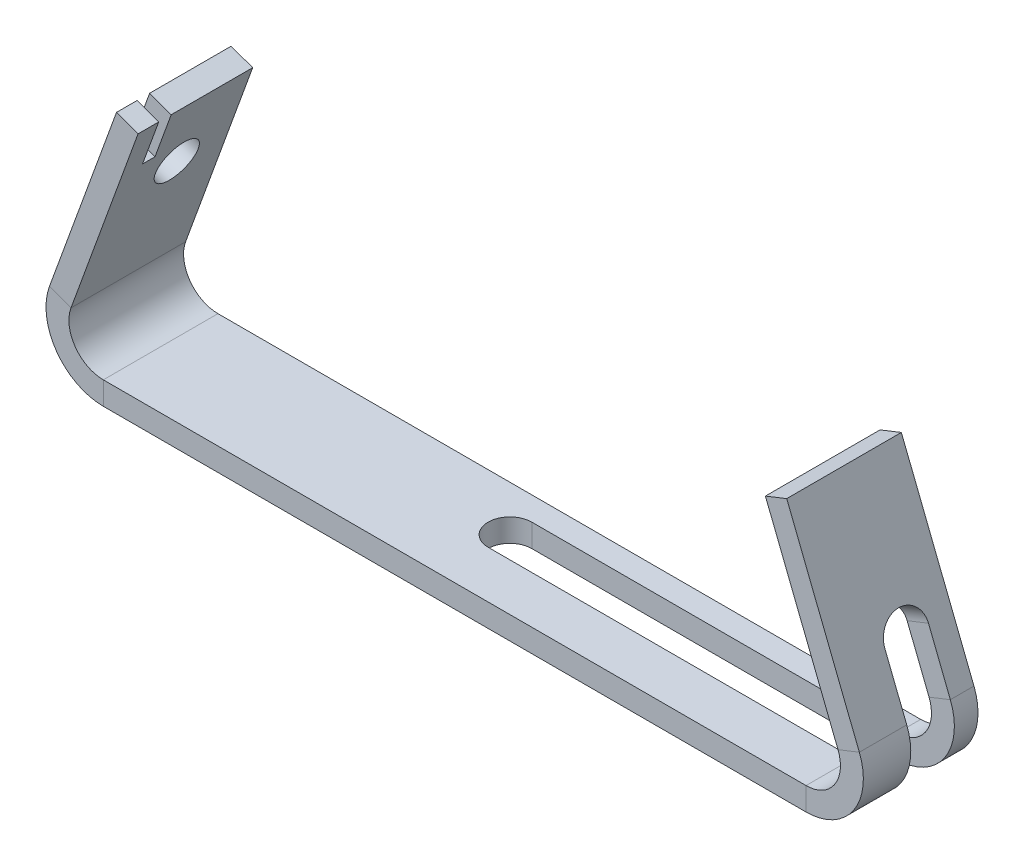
ISO-10303-21;
HEADER;
FILE_DESCRIPTION(('STEP AP214'),'2;1');
FILE_NAME('part.step','',(''),(''),'','','');
FILE_SCHEMA(('AUTOMOTIVE_DESIGN { 1 0 10303 214 1 1 1 1 }'));
ENDSEC;
DATA;
#1=APPLICATION_CONTEXT('core data for automotive mechanical design processes');
#2=APPLICATION_PROTOCOL_DEFINITION('international standard','automotive_design',2000,#1);
#3=PRODUCT_CONTEXT('',#1,'mechanical');
#4=PRODUCT('Part','Part','',(#3));
#5=PRODUCT_RELATED_PRODUCT_CATEGORY('part','',(#4));
#6=PRODUCT_DEFINITION_FORMATION('','',#4);
#7=PRODUCT_DEFINITION_CONTEXT('part definition',#1,'design');
#8=PRODUCT_DEFINITION('design','',#6,#7);
#9=PRODUCT_DEFINITION_SHAPE('','',#8);
#10=(LENGTH_UNIT() NAMED_UNIT(*) SI_UNIT(.MILLI.,.METRE.));
#11=(NAMED_UNIT(*) PLANE_ANGLE_UNIT() SI_UNIT($,.RADIAN.));
#12=(NAMED_UNIT(*) SI_UNIT($,.STERADIAN.) SOLID_ANGLE_UNIT());
#13=UNCERTAINTY_MEASURE_WITH_UNIT(LENGTH_MEASURE(1.E-05),#10,'distance_accuracy_value','');
#14=(GEOMETRIC_REPRESENTATION_CONTEXT(3) GLOBAL_UNCERTAINTY_ASSIGNED_CONTEXT((#13)) GLOBAL_UNIT_ASSIGNED_CONTEXT((#10,
#11,#12)) REPRESENTATION_CONTEXT('',''));
#15=CARTESIAN_POINT('',(0.,0.,0.));
#16=DIRECTION('',(0.,0.,1.));
#17=DIRECTION('',(1.,0.,0.));
#18=AXIS2_PLACEMENT_3D('',#15,#16,#17);
#19=CARTESIAN_POINT('',(-35.,0.,10.));
#20=DIRECTION('',(0.,1.,0.));
#21=DIRECTION('',(0.,0.,1.));
#22=AXIS2_PLACEMENT_3D('',#19,#20,#21);
#23=PLANE('',#22);
#24=CARTESIAN_POINT('',(-1.28081386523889,0.,3.96320794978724));
#25=DIRECTION('',(0.,1.,0.));
#26=DIRECTION('',(0.,0.,1.));
#27=AXIS2_PLACEMENT_3D('',#24,#25,#26);
#28=CIRCLE('',#27,1.90265373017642);
#29=CARTESIAN_POINT('',(-1.28081386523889,0.,2.06055421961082));
#30=VERTEX_POINT('',#29);
#31=CARTESIAN_POINT('',(-1.28081386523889,0.,5.86586167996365));
#32=VERTEX_POINT('',#31);
#33=EDGE_CURVE('E230',#30,#32,#28,.T.);
#34=ORIENTED_EDGE('',*,*,#33,.F.);
#35=DIRECTION('',(-1.,0.,0.));
#36=VECTOR('',#35,1.);
#37=CARTESIAN_POINT('',(-35.,0.,2.06055421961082));
#38=LINE('',#37,#36);
#39=CARTESIAN_POINT('',(30.5847915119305,0.,2.06055421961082));
#40=VERTEX_POINT('',#39);
#41=EDGE_CURVE('E214',#40,#30,#38,.T.);
#42=ORIENTED_EDGE('',*,*,#41,.F.);
#43=DIRECTION('',(0.,0.,-1.));
#44=VECTOR('',#43,1.);
#45=CARTESIAN_POINT('',(30.5847915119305,0.,10.));
#46=LINE('',#45,#44);
#47=CARTESIAN_POINT('',(30.5847915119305,0.,0.));
#48=VERTEX_POINT('',#47);
#49=EDGE_CURVE('E411',#40,#48,#46,.T.);
#50=ORIENTED_EDGE('',*,*,#49,.T.);
#51=DIRECTION('',(1.,0.,0.));
#52=VECTOR('',#51,1.);
#53=CARTESIAN_POINT('',(-35.,0.,0.));
#54=LINE('',#53,#52);
#55=CARTESIAN_POINT('',(-30.7155559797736,0.,0.));
#56=VERTEX_POINT('',#55);
#57=EDGE_CURVE('E361',#56,#48,#54,.T.);
#58=ORIENTED_EDGE('',*,*,#57,.F.);
#59=DIRECTION('',(0.,0.,-1.));
#60=VECTOR('',#59,1.);
#61=CARTESIAN_POINT('',(-30.7155559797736,0.,10.));
#62=LINE('',#61,#60);
#63=CARTESIAN_POINT('',(-30.7155559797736,0.,10.));
#64=VERTEX_POINT('',#63);
#65=EDGE_CURVE('E408',#64,#56,#62,.T.);
#66=ORIENTED_EDGE('',*,*,#65,.F.);
#67=DIRECTION('',(1.,0.,0.));
#68=VECTOR('',#67,1.);
#69=CARTESIAN_POINT('',(-35.,0.,10.));
#70=LINE('',#69,#68);
#71=CARTESIAN_POINT('',(30.5847915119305,0.,10.));
#72=VERTEX_POINT('',#71);
#73=EDGE_CURVE('E325',#64,#72,#70,.T.);
#74=ORIENTED_EDGE('',*,*,#73,.T.);
#75=CARTESIAN_POINT('',(30.5847915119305,0.,5.86586167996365));
#76=VERTEX_POINT('',#75);
#77=EDGE_CURVE('E412',#72,#76,#46,.T.);
#78=ORIENTED_EDGE('',*,*,#77,.T.);
#79=DIRECTION('',(1.,0.,0.));
#80=VECTOR('',#79,1.);
#81=CARTESIAN_POINT('',(-35.,0.,5.86586167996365));
#82=LINE('',#81,#80);
#83=EDGE_CURVE('E224',#32,#76,#82,.T.);
#84=ORIENTED_EDGE('',*,*,#83,.F.);
#85=EDGE_LOOP('',(#34,#42,#50,#58,#66,#74,#78,#84));
#86=FACE_BOUND('',#85,.T.);
#87=ADVANCED_FACE('F51',(#86),#23,.T.);
#88=CARTESIAN_POINT('',(-35.,-2.,10.));
#89=DIRECTION('',(0.,1.,0.));
#90=DIRECTION('',(0.,0.,1.));
#91=AXIS2_PLACEMENT_3D('',#88,#89,#90);
#92=PLANE('',#91);
#93=DIRECTION('',(1.,0.,0.));
#94=VECTOR('',#93,1.);
#95=CARTESIAN_POINT('',(-35.,-2.,2.06055421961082));
#96=LINE('',#95,#94);
#97=CARTESIAN_POINT('',(30.5847915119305,-2.,2.06055421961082));
#98=VERTEX_POINT('',#97);
#99=CARTESIAN_POINT('',(-1.28081386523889,-2.,2.06055421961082));
#100=VERTEX_POINT('',#99);
#101=EDGE_CURVE('E250',#98,#100,#96,.F.);
#102=ORIENTED_EDGE('',*,*,#101,.T.);
#103=CARTESIAN_POINT('',(-1.28081386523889,-2.,3.96320794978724));
#104=DIRECTION('',(0.,1.,0.));
#105=DIRECTION('',(0.,0.,1.));
#106=AXIS2_PLACEMENT_3D('',#103,#104,#105);
#107=CIRCLE('',#106,1.90265373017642);
#108=CARTESIAN_POINT('',(-1.28081386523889,-2.,5.86586167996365));
#109=VERTEX_POINT('',#108);
#110=EDGE_CURVE('E232',#100,#109,#107,.T.);
#111=ORIENTED_EDGE('',*,*,#110,.T.);
#112=DIRECTION('',(1.,0.,0.));
#113=VECTOR('',#112,1.);
#114=CARTESIAN_POINT('',(-35.,-2.,5.86586167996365));
#115=LINE('',#114,#113);
#116=CARTESIAN_POINT('',(30.5847915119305,-2.,5.86586167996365));
#117=VERTEX_POINT('',#116);
#118=EDGE_CURVE('E66',#109,#117,#115,.T.);
#119=ORIENTED_EDGE('',*,*,#118,.T.);
#120=DIRECTION('',(0.,0.,-1.));
#121=VECTOR('',#120,1.);
#122=CARTESIAN_POINT('',(30.5847915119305,-2.,10.));
#123=LINE('',#122,#121);
#124=CARTESIAN_POINT('',(30.5847915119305,-2.,10.));
#125=VERTEX_POINT('',#124);
#126=EDGE_CURVE('E388',#125,#117,#123,.T.);
#127=ORIENTED_EDGE('',*,*,#126,.F.);
#128=DIRECTION('',(1.,0.,0.));
#129=VECTOR('',#128,1.);
#130=CARTESIAN_POINT('',(-35.,-2.,10.));
#131=LINE('',#130,#129);
#132=CARTESIAN_POINT('',(-30.7155559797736,-2.,10.));
#133=VERTEX_POINT('',#132);
#134=EDGE_CURVE('E343',#133,#125,#131,.T.);
#135=ORIENTED_EDGE('',*,*,#134,.F.);
#136=DIRECTION('',(0.,0.,-1.));
#137=VECTOR('',#136,1.);
#138=CARTESIAN_POINT('',(-30.7155559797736,-2.,10.));
#139=LINE('',#138,#137);
#140=CARTESIAN_POINT('',(-30.7155559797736,-2.,0.));
#141=VERTEX_POINT('',#140);
#142=EDGE_CURVE('E391',#133,#141,#139,.T.);
#143=ORIENTED_EDGE('',*,*,#142,.T.);
#144=DIRECTION('',(1.,0.,0.));
#145=VECTOR('',#144,1.);
#146=CARTESIAN_POINT('',(-35.,-2.,0.));
#147=LINE('',#146,#145);
#148=CARTESIAN_POINT('',(30.5847915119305,-2.,0.));
#149=VERTEX_POINT('',#148);
#150=EDGE_CURVE('E379',#141,#149,#147,.T.);
#151=ORIENTED_EDGE('',*,*,#150,.T.);
#152=EDGE_CURVE('E387',#98,#149,#123,.T.);
#153=ORIENTED_EDGE('',*,*,#152,.F.);
#154=EDGE_LOOP('',(#102,#111,#119,#127,#135,#143,#151,#153));
#155=FACE_BOUND('',#154,.T.);
#156=ADVANCED_FACE('F504',(#155),#92,.F.);
#157=CARTESIAN_POINT('',(36.8594223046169,0.736579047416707,10.));
#158=DIRECTION('',(-0.929711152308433,-0.368289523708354,0.));
#159=DIRECTION('',(0.368289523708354,-0.929711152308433,0.));
#160=AXIS2_PLACEMENT_3D('',#157,#158,#159);
#161=PLANE('',#160);
#162=DIRECTION('',(0.368289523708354,-0.929711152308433,0.));
#163=VECTOR('',#162,1.);
#164=CARTESIAN_POINT('',(36.8594223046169,0.736579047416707,2.06055421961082));
#165=LINE('',#164,#163);
#166=CARTESIAN_POINT('',(33.3239284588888,9.66159006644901,2.06055421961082));
#167=VERTEX_POINT('',#166);
#168=CARTESIAN_POINT('',(35.2333472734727,4.84144761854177,2.06055421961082));
#169=VERTEX_POINT('',#168);
#170=EDGE_CURVE('E258',#167,#169,#165,.T.);
#171=ORIENTED_EDGE('',*,*,#170,.T.);
#172=DIRECTION('',(0.,0.,-1.));
#173=VECTOR('',#172,1.);
#174=CARTESIAN_POINT('',(35.2333472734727,4.84144761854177,10.));
#175=LINE('',#174,#173);
#176=CARTESIAN_POINT('',(35.2333472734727,4.84144761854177,0.));
#177=VERTEX_POINT('',#176);
#178=EDGE_CURVE('E349',#169,#177,#175,.T.);
#179=ORIENTED_EDGE('',*,*,#178,.T.);
#180=DIRECTION('',(-0.368289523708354,0.929711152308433,0.));
#181=VECTOR('',#180,1.);
#182=CARTESIAN_POINT('',(36.8594223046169,0.736579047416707,0.));
#183=LINE('',#182,#181);
#184=CARTESIAN_POINT('',(28.8983028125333,20.8336524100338,0.));
#185=VERTEX_POINT('',#184);
#186=EDGE_CURVE('E310',#177,#185,#183,.T.);
#187=ORIENTED_EDGE('',*,*,#186,.T.);
#188=DIRECTION('',(0.,0.,-1.));
#189=VECTOR('',#188,1.);
#190=CARTESIAN_POINT('',(28.8983028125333,20.8336524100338,10.));
#191=LINE('',#190,#189);
#192=CARTESIAN_POINT('',(28.8983028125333,20.8336524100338,10.));
#193=VERTEX_POINT('',#192);
#194=EDGE_CURVE('E420',#193,#185,#191,.T.);
#195=ORIENTED_EDGE('',*,*,#194,.F.);
#196=DIRECTION('',(-0.368289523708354,0.929711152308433,0.));
#197=VECTOR('',#196,1.);
#198=CARTESIAN_POINT('',(36.8594223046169,0.736579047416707,10.));
#199=LINE('',#198,#197);
#200=CARTESIAN_POINT('',(35.2333472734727,4.84144761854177,10.));
#201=VERTEX_POINT('',#200);
#202=EDGE_CURVE('E313',#201,#193,#199,.T.);
#203=ORIENTED_EDGE('',*,*,#202,.F.);
#204=CARTESIAN_POINT('',(35.2333472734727,4.84144761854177,5.86586167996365));
#205=VERTEX_POINT('',#204);
#206=EDGE_CURVE('E384',#201,#205,#175,.T.);
#207=ORIENTED_EDGE('',*,*,#206,.T.);
#208=DIRECTION('',(0.368289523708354,-0.929711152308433,0.));
#209=VECTOR('',#208,1.);
#210=CARTESIAN_POINT('',(36.8594223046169,0.736579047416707,5.86586167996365));
#211=LINE('',#210,#209);
#212=CARTESIAN_POINT('',(33.3239284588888,9.66159006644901,5.86586167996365));
#213=VERTEX_POINT('',#212);
#214=EDGE_CURVE('E264',#205,#213,#211,.F.);
#215=ORIENTED_EDGE('',*,*,#214,.T.);
#216=CARTESIAN_POINT('',(33.3239284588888,9.66159006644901,3.96320794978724));
#217=DIRECTION('',(-0.929711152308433,-0.368289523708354,0.));
#218=DIRECTION('',(0.368289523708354,-0.929711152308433,0.));
#219=AXIS2_PLACEMENT_3D('',#216,#217,#218);
#220=CIRCLE('',#219,1.90265373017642);
#221=EDGE_CURVE('E261',#213,#167,#220,.T.);
#222=ORIENTED_EDGE('',*,*,#221,.T.);
#223=EDGE_LOOP('',(#171,#179,#187,#195,#203,#207,#215,#222));
#224=FACE_BOUND('',#223,.T.);
#225=ADVANCED_FACE('F451',(#224),#161,.F.);
#226=CARTESIAN_POINT('',(35.,0.,10.));
#227=DIRECTION('',(-0.929711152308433,-0.368289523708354,0.));
#228=DIRECTION('',(0.368289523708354,-0.929711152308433,0.));
#229=AXIS2_PLACEMENT_3D('',#226,#227,#228);
#230=PLANE('',#229);
#231=DIRECTION('',(0.,0.,-1.));
#232=VECTOR('',#231,1.);
#233=CARTESIAN_POINT('',(33.3739249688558,4.10486857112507,10.));
#234=LINE('',#233,#232);
#235=CARTESIAN_POINT('',(33.3739249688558,4.10486857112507,2.06055421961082));
#236=VERTEX_POINT('',#235);
#237=CARTESIAN_POINT('',(33.3739249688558,4.10486857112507,0.));
#238=VERTEX_POINT('',#237);
#239=EDGE_CURVE('E414',#236,#238,#234,.T.);
#240=ORIENTED_EDGE('',*,*,#239,.F.);
#241=DIRECTION('',(0.368289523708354,-0.929711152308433,0.));
#242=VECTOR('',#241,1.);
#243=CARTESIAN_POINT('',(35.,0.,2.06055421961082));
#244=LINE('',#243,#242);
#245=CARTESIAN_POINT('',(31.4645061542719,8.9250110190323,2.06055421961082));
#246=VERTEX_POINT('',#245);
#247=EDGE_CURVE('E267',#246,#236,#244,.T.);
#248=ORIENTED_EDGE('',*,*,#247,.F.);
#249=CARTESIAN_POINT('',(31.4645061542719,8.9250110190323,3.96320794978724));
#250=DIRECTION('',(-0.929711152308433,-0.368289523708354,0.));
#251=DIRECTION('',(0.368289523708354,-0.929711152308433,0.));
#252=AXIS2_PLACEMENT_3D('',#249,#250,#251);
#253=CIRCLE('',#252,1.90265373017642);
#254=CARTESIAN_POINT('',(31.4645061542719,8.9250110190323,5.86586167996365));
#255=VERTEX_POINT('',#254);
#256=EDGE_CURVE('E269',#255,#246,#253,.T.);
#257=ORIENTED_EDGE('',*,*,#256,.F.);
#258=DIRECTION('',(-0.368289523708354,0.929711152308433,0.));
#259=VECTOR('',#258,1.);
#260=CARTESIAN_POINT('',(35.,0.,5.86586167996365));
#261=LINE('',#260,#259);
#262=CARTESIAN_POINT('',(33.3739249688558,4.10486857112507,5.86586167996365));
#263=VERTEX_POINT('',#262);
#264=EDGE_CURVE('E257',#263,#255,#261,.T.);
#265=ORIENTED_EDGE('',*,*,#264,.F.);
#266=CARTESIAN_POINT('',(33.3739249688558,4.10486857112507,10.));
#267=VERTEX_POINT('',#266);
#268=EDGE_CURVE('E415',#267,#263,#234,.T.);
#269=ORIENTED_EDGE('',*,*,#268,.F.);
#270=DIRECTION('',(-0.368289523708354,0.929711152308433,0.));
#271=VECTOR('',#270,1.);
#272=CARTESIAN_POINT('',(35.,0.,10.));
#273=LINE('',#272,#271);
#274=CARTESIAN_POINT('',(27.0388805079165,20.0970733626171,10.));
#275=VERTEX_POINT('',#274);
#276=EDGE_CURVE('E319',#267,#275,#273,.T.);
#277=ORIENTED_EDGE('',*,*,#276,.T.);
#278=DIRECTION('',(0.,0.,-1.));
#279=VECTOR('',#278,1.);
#280=CARTESIAN_POINT('',(27.0388805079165,20.0970733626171,10.));
#281=LINE('',#280,#279);
#282=CARTESIAN_POINT('',(27.0388805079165,20.0970733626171,0.));
#283=VERTEX_POINT('',#282);
#284=EDGE_CURVE('E418',#275,#283,#281,.T.);
#285=ORIENTED_EDGE('',*,*,#284,.T.);
#286=DIRECTION('',(-0.368289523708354,0.929711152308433,0.));
#287=VECTOR('',#286,1.);
#288=CARTESIAN_POINT('',(35.,0.,0.));
#289=LINE('',#288,#287);
#290=EDGE_CURVE('E355',#238,#283,#289,.T.);
#291=ORIENTED_EDGE('',*,*,#290,.F.);
#292=EDGE_LOOP('',(#240,#248,#257,#265,#269,#277,#285,#291));
#293=FACE_BOUND('',#292,.T.);
#294=ADVANCED_FACE('F458',(#293),#230,.T.);
#295=CARTESIAN_POINT('',(30.5847915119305,3.,10.));
#296=DIRECTION('',(0.,0.,-1.));
#297=DIRECTION('',(-1.,0.,0.));
#298=AXIS2_PLACEMENT_3D('',#295,#296,#297);
#299=CYLINDRICAL_SURFACE('',#298,3.);
#300=ORIENTED_EDGE('',*,*,#49,.F.);
#301=CARTESIAN_POINT('',(30.5847915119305,3.,2.06055421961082));
#302=DIRECTION('',(0.,0.,-1.));
#303=DIRECTION('',(-1.,0.,0.));
#304=AXIS2_PLACEMENT_3D('',#301,#302,#303);
#305=CIRCLE('',#304,3.);
#306=EDGE_CURVE('E247',#236,#40,#305,.T.);
#307=ORIENTED_EDGE('',*,*,#306,.F.);
#308=ORIENTED_EDGE('',*,*,#239,.T.);
#309=CARTESIAN_POINT('',(30.5847915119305,3.,0.));
#310=DIRECTION('',(0.,0.,1.));
#311=DIRECTION('',(1.,0.,0.));
#312=AXIS2_PLACEMENT_3D('',#309,#310,#311);
#313=CIRCLE('',#312,3.);
#314=EDGE_CURVE('E358',#48,#238,#313,.T.);
#315=ORIENTED_EDGE('',*,*,#314,.F.);
#316=EDGE_LOOP('',(#300,#307,#308,#315));
#317=FACE_BOUND('',#316,.T.);
#318=ADVANCED_FACE('F522',(#317),#299,.F.);
#319=ORIENTED_EDGE('',*,*,#268,.T.);
#320=CARTESIAN_POINT('',(30.5847915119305,3.,5.86586167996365));
#321=DIRECTION('',(0.,0.,1.));
#322=DIRECTION('',(1.,0.,0.));
#323=AXIS2_PLACEMENT_3D('',#320,#321,#322);
#324=CIRCLE('',#323,3.);
#325=EDGE_CURVE('E233',#76,#263,#324,.T.);
#326=ORIENTED_EDGE('',*,*,#325,.F.);
#327=ORIENTED_EDGE('',*,*,#77,.F.);
#328=CARTESIAN_POINT('',(30.5847915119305,3.,10.));
#329=DIRECTION('',(0.,0.,1.));
#330=DIRECTION('',(1.,0.,0.));
#331=AXIS2_PLACEMENT_3D('',#328,#329,#330);
#332=CIRCLE('',#331,3.);
#333=EDGE_CURVE('E322',#72,#267,#332,.T.);
#334=ORIENTED_EDGE('',*,*,#333,.T.);
#335=EDGE_LOOP('',(#319,#326,#327,#334));
#336=FACE_BOUND('',#335,.T.);
#337=ADVANCED_FACE('F464',(#336),#299,.F.);
#338=CARTESIAN_POINT('',(30.5847915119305,3.,10.));
#339=DIRECTION('',(0.,0.,-1.));
#340=DIRECTION('',(-1.,0.,0.));
#341=AXIS2_PLACEMENT_3D('',#338,#339,#340);
#342=CYLINDRICAL_SURFACE('',#341,5.);
#343=CARTESIAN_POINT('',(30.5847915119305,3.,2.06055421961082));
#344=DIRECTION('',(0.,0.,-1.));
#345=DIRECTION('',(-1.,0.,0.));
#346=AXIS2_PLACEMENT_3D('',#343,#344,#345);
#347=CIRCLE('',#346,5.);
#348=EDGE_CURVE('E241',#169,#98,#347,.T.);
#349=ORIENTED_EDGE('',*,*,#348,.T.);
#350=ORIENTED_EDGE('',*,*,#152,.T.);
#351=CARTESIAN_POINT('',(30.5847915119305,3.,0.));
#352=DIRECTION('',(0.,0.,1.));
#353=DIRECTION('',(1.,0.,0.));
#354=AXIS2_PLACEMENT_3D('',#351,#352,#353);
#355=CIRCLE('',#354,5.);
#356=EDGE_CURVE('E316',#149,#177,#355,.T.);
#357=ORIENTED_EDGE('',*,*,#356,.T.);
#358=ORIENTED_EDGE('',*,*,#178,.F.);
#359=EDGE_LOOP('',(#349,#350,#357,#358));
#360=FACE_BOUND('',#359,.T.);
#361=ADVANCED_FACE('F511',(#360),#342,.T.);
#362=CARTESIAN_POINT('',(30.5847915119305,3.,5.86586167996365));
#363=DIRECTION('',(0.,0.,-1.));
#364=DIRECTION('',(-1.,0.,0.));
#365=AXIS2_PLACEMENT_3D('',#362,#363,#364);
#366=CIRCLE('',#365,5.);
#367=EDGE_CURVE('E244',#117,#205,#366,.F.);
#368=ORIENTED_EDGE('',*,*,#367,.T.);
#369=ORIENTED_EDGE('',*,*,#206,.F.);
#370=CARTESIAN_POINT('',(30.5847915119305,3.,10.));
#371=DIRECTION('',(0.,0.,1.));
#372=DIRECTION('',(1.,0.,0.));
#373=AXIS2_PLACEMENT_3D('',#370,#371,#372);
#374=CIRCLE('',#373,5.);
#375=EDGE_CURVE('E346',#125,#201,#374,.T.);
#376=ORIENTED_EDGE('',*,*,#375,.F.);
#377=ORIENTED_EDGE('',*,*,#126,.T.);
#378=EDGE_LOOP('',(#368,#369,#376,#377));
#379=FACE_BOUND('',#378,.T.);
#380=ADVANCED_FACE('F449',(#379),#342,.T.);
#381=CARTESIAN_POINT('',(-29.5646487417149,20.7811136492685,10.));
#382=DIRECTION('',(0.342020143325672,0.939692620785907,0.));
#383=DIRECTION('',(-0.939692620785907,0.342020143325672,0.));
#384=AXIS2_PLACEMENT_3D('',#381,#382,#383);
#385=PLANE('',#384);
#386=DIRECTION('',(0.939692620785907,-0.342020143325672,0.));
#387=VECTOR('',#386,1.);
#388=CARTESIAN_POINT('',(-29.5646487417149,20.7811136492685,8.1954112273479));
#389=LINE('',#388,#387);
#390=CARTESIAN_POINT('',(-29.5646487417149,20.7811136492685,8.1954112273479));
#391=VERTEX_POINT('',#390);
#392=CARTESIAN_POINT('',(-27.6852635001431,20.0970733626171,8.1954112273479));
#393=VERTEX_POINT('',#392);
#394=EDGE_CURVE('E304',#391,#393,#389,.T.);
#395=ORIENTED_EDGE('',*,*,#394,.F.);
#396=DIRECTION('',(0.,0.,-1.));
#397=VECTOR('',#396,1.);
#398=CARTESIAN_POINT('',(-29.5646487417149,20.7811136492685,10.));
#399=LINE('',#398,#397);
#400=CARTESIAN_POINT('',(-29.5646487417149,20.7811136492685,10.));
#401=VERTEX_POINT('',#400);
#402=EDGE_CURVE('E398',#401,#391,#399,.T.);
#403=ORIENTED_EDGE('',*,*,#402,.F.);
#404=DIRECTION('',(0.939692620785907,-0.342020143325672,0.));
#405=VECTOR('',#404,1.);
#406=CARTESIAN_POINT('',(-29.5646487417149,20.7811136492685,10.));
#407=LINE('',#406,#405);
#408=CARTESIAN_POINT('',(-27.6852635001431,20.0970733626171,10.));
#409=VERTEX_POINT('',#408);
#410=EDGE_CURVE('E334',#401,#409,#407,.T.);
#411=ORIENTED_EDGE('',*,*,#410,.T.);
#412=DIRECTION('',(0.,0.,-1.));
#413=VECTOR('',#412,1.);
#414=CARTESIAN_POINT('',(-27.6852635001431,20.0970733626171,10.));
#415=LINE('',#414,#413);
#416=EDGE_CURVE('E402',#409,#393,#415,.T.);
#417=ORIENTED_EDGE('',*,*,#416,.T.);
#418=EDGE_LOOP('',(#395,#403,#411,#417));
#419=FACE_BOUND('',#418,.T.);
#420=ADVANCED_FACE('F488',(#419),#385,.T.);
#421=CARTESIAN_POINT('',(33.3739249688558,4.10486857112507,10.));
#422=DIRECTION('',(0.,0.,1.));
#423=DIRECTION('',(1.,0.,0.));
#424=AXIS2_PLACEMENT_3D('',#421,#422,#423);
#425=PLANE('',#424);
#426=DIRECTION('',(0.929711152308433,0.368289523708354,0.));
#427=VECTOR('',#426,1.);
#428=CARTESIAN_POINT('',(33.3739249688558,4.10486857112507,10.));
#429=LINE('',#428,#427);
#430=EDGE_CURVE('E59',#267,#201,#429,.T.);
#431=ORIENTED_EDGE('',*,*,#430,.F.);
#432=ORIENTED_EDGE('',*,*,#333,.F.);
#433=DIRECTION('',(0.,1.,0.));
#434=VECTOR('',#433,1.);
#435=CARTESIAN_POINT('',(30.5847915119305,-2.,10.));
#436=LINE('',#435,#434);
#437=EDGE_CURVE('E436',#125,#72,#436,.T.);
#438=ORIENTED_EDGE('',*,*,#437,.F.);
#439=ORIENTED_EDGE('',*,*,#375,.T.);
#440=EDGE_LOOP('',(#431,#432,#438,#439));
#441=FACE_BOUND('',#440,.T.);
#442=ADVANCED_FACE('F53',(#441),#425,.T.);
#443=CARTESIAN_POINT('',(30.5847915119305,-2.,10.));
#444=DIRECTION('',(0.,0.,1.));
#445=DIRECTION('',(1.,0.,0.));
#446=AXIS2_PLACEMENT_3D('',#443,#444,#445);
#447=PLANE('',#446);
#448=ORIENTED_EDGE('',*,*,#276,.F.);
#449=ORIENTED_EDGE('',*,*,#430,.T.);
#450=ORIENTED_EDGE('',*,*,#202,.T.);
#451=DIRECTION('',(0.929711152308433,0.368289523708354,0.));
#452=VECTOR('',#451,1.);
#453=CARTESIAN_POINT('',(27.0388805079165,20.0970733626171,10.));
#454=LINE('',#453,#452);
#455=EDGE_CURVE('E315',#275,#193,#454,.T.);
#456=ORIENTED_EDGE('',*,*,#455,.F.);
#457=EDGE_LOOP('',(#448,#449,#450,#456));
#458=FACE_BOUND('',#457,.T.);
#459=ADVANCED_FACE('F439',(#458),#447,.T.);
#460=CARTESIAN_POINT('',(30.5847915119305,0.,0.));
#461=DIRECTION('',(0.,0.,-1.));
#462=DIRECTION('',(-1.,0.,0.));
#463=AXIS2_PLACEMENT_3D('',#460,#461,#462);
#464=PLANE('',#463);
#465=DIRECTION('',(0.,-1.,0.));
#466=VECTOR('',#465,1.);
#467=CARTESIAN_POINT('',(30.5847915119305,0.,0.));
#468=LINE('',#467,#466);
#469=EDGE_CURVE('E433',#48,#149,#468,.T.);
#470=ORIENTED_EDGE('',*,*,#469,.F.);
#471=ORIENTED_EDGE('',*,*,#314,.T.);
#472=DIRECTION('',(-0.929711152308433,-0.368289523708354,0.));
#473=VECTOR('',#472,1.);
#474=CARTESIAN_POINT('',(35.2333472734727,4.84144761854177,0.));
#475=LINE('',#474,#473);
#476=EDGE_CURVE('E430',#177,#238,#475,.T.);
#477=ORIENTED_EDGE('',*,*,#476,.F.);
#478=ORIENTED_EDGE('',*,*,#356,.F.);
#479=EDGE_LOOP('',(#470,#471,#477,#478));
#480=FACE_BOUND('',#479,.T.);
#481=ADVANCED_FACE('F516',(#480),#464,.T.);
#482=CARTESIAN_POINT('',(35.2333472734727,4.84144761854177,0.));
#483=DIRECTION('',(0.,0.,-1.));
#484=DIRECTION('',(-1.,0.,0.));
#485=AXIS2_PLACEMENT_3D('',#482,#483,#484);
#486=PLANE('',#485);
#487=ORIENTED_EDGE('',*,*,#57,.T.);
#488=ORIENTED_EDGE('',*,*,#469,.T.);
#489=ORIENTED_EDGE('',*,*,#150,.F.);
#490=DIRECTION('',(0.,1.,0.));
#491=VECTOR('',#490,1.);
#492=CARTESIAN_POINT('',(-30.7155559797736,-2.,0.));
#493=LINE('',#492,#491);
#494=EDGE_CURVE('E422',#141,#56,#493,.T.);
#495=ORIENTED_EDGE('',*,*,#494,.T.);
#496=EDGE_LOOP('',(#487,#488,#489,#495));
#497=FACE_BOUND('',#496,.T.);
#498=ADVANCED_FACE('F524',(#497),#486,.T.);
#499=CARTESIAN_POINT('',(-30.7155559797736,0.,10.));
#500=DIRECTION('',(0.,0.,1.));
#501=DIRECTION('',(1.,0.,0.));
#502=AXIS2_PLACEMENT_3D('',#499,#500,#501);
#503=PLANE('',#502);
#504=DIRECTION('',(0.,-1.,0.));
#505=VECTOR('',#504,1.);
#506=CARTESIAN_POINT('',(-30.7155559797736,0.,10.));
#507=LINE('',#506,#505);
#508=EDGE_CURVE('E428',#64,#133,#507,.T.);
#509=ORIENTED_EDGE('',*,*,#508,.F.);
#510=CARTESIAN_POINT('',(-30.7155559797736,3.,10.));
#511=DIRECTION('',(0.,0.,1.));
#512=DIRECTION('',(1.,0.,0.));
#513=AXIS2_PLACEMENT_3D('',#510,#511,#512);
#514=CIRCLE('',#513,3.);
#515=CARTESIAN_POINT('',(-33.5346338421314,4.02606042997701,10.));
#516=VERTEX_POINT('',#515);
#517=EDGE_CURVE('E328',#516,#64,#514,.T.);
#518=ORIENTED_EDGE('',*,*,#517,.F.);
#519=DIRECTION('',(0.939692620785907,-0.342020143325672,0.));
#520=VECTOR('',#519,1.);
#521=CARTESIAN_POINT('',(-35.4140190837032,4.71010071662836,10.));
#522=LINE('',#521,#520);
#523=CARTESIAN_POINT('',(-35.4140190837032,4.71010071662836,10.));
#524=VERTEX_POINT('',#523);
#525=EDGE_CURVE('E426',#524,#516,#522,.T.);
#526=ORIENTED_EDGE('',*,*,#525,.F.);
#527=CARTESIAN_POINT('',(-30.7155559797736,3.,10.));
#528=DIRECTION('',(0.,0.,1.));
#529=DIRECTION('',(1.,0.,0.));
#530=AXIS2_PLACEMENT_3D('',#527,#528,#529);
#531=CIRCLE('',#530,5.);
#532=EDGE_CURVE('E340',#524,#133,#531,.T.);
#533=ORIENTED_EDGE('',*,*,#532,.T.);
#534=EDGE_LOOP('',(#509,#518,#526,#533));
#535=FACE_BOUND('',#534,.T.);
#536=ADVANCED_FACE('F477',(#535),#503,.T.);
#537=CARTESIAN_POINT('',(-35.4140190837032,4.71010071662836,10.));
#538=DIRECTION('',(0.,0.,1.));
#539=DIRECTION('',(1.,0.,0.));
#540=AXIS2_PLACEMENT_3D('',#537,#538,#539);
#541=PLANE('',#540);
#542=ORIENTED_EDGE('',*,*,#73,.F.);
#543=ORIENTED_EDGE('',*,*,#508,.T.);
#544=ORIENTED_EDGE('',*,*,#134,.T.);
#545=ORIENTED_EDGE('',*,*,#437,.T.);
#546=EDGE_LOOP('',(#542,#543,#544,#545));
#547=FACE_BOUND('',#546,.T.);
#548=ADVANCED_FACE('F470',(#547),#541,.T.);
#549=CARTESIAN_POINT('',(-33.5346338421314,4.02606042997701,0.));
#550=DIRECTION('',(0.,0.,-1.));
#551=DIRECTION('',(-1.,0.,0.));
#552=AXIS2_PLACEMENT_3D('',#549,#550,#551);
#553=PLANE('',#552);
#554=DIRECTION('',(-0.939692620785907,0.342020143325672,0.));
#555=VECTOR('',#554,1.);
#556=CARTESIAN_POINT('',(-33.5346338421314,4.02606042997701,0.));
#557=LINE('',#556,#555);
#558=CARTESIAN_POINT('',(-33.5346338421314,4.02606042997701,0.));
#559=VERTEX_POINT('',#558);
#560=CARTESIAN_POINT('',(-35.4140190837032,4.71010071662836,0.));
#561=VERTEX_POINT('',#560);
#562=EDGE_CURVE('E424',#559,#561,#557,.T.);
#563=ORIENTED_EDGE('',*,*,#562,.F.);
#564=CARTESIAN_POINT('',(-30.7155559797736,3.,0.));
#565=DIRECTION('',(0.,0.,1.));
#566=DIRECTION('',(1.,0.,0.));
#567=AXIS2_PLACEMENT_3D('',#564,#565,#566);
#568=CIRCLE('',#567,3.);
#569=EDGE_CURVE('E364',#559,#56,#568,.T.);
#570=ORIENTED_EDGE('',*,*,#569,.T.);
#571=ORIENTED_EDGE('',*,*,#494,.F.);
#572=CARTESIAN_POINT('',(-30.7155559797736,3.,0.));
#573=DIRECTION('',(0.,0.,1.));
#574=DIRECTION('',(1.,0.,0.));
#575=AXIS2_PLACEMENT_3D('',#572,#573,#574);
#576=CIRCLE('',#575,5.);
#577=EDGE_CURVE('E376',#561,#141,#576,.T.);
#578=ORIENTED_EDGE('',*,*,#577,.F.);
#579=EDGE_LOOP('',(#563,#570,#571,#578));
#580=FACE_BOUND('',#579,.T.);
#581=ADVANCED_FACE('F526',(#580),#553,.T.);
#582=CARTESIAN_POINT('',(-30.7155559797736,-2.,0.));
#583=DIRECTION('',(0.,0.,-1.));
#584=DIRECTION('',(-1.,0.,0.));
#585=AXIS2_PLACEMENT_3D('',#582,#583,#584);
#586=PLANE('',#585);
#587=DIRECTION('',(-0.342020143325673,-0.939692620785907,0.));
#588=VECTOR('',#587,1.);
#589=CARTESIAN_POINT('',(-27.6852635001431,20.0970733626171,0.));
#590=LINE('',#589,#588);
#591=CARTESIAN_POINT('',(-27.6852635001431,20.0970733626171,0.));
#592=VERTEX_POINT('',#591);
#593=EDGE_CURVE('E367',#592,#559,#590,.T.);
#594=ORIENTED_EDGE('',*,*,#593,.T.);
#595=ORIENTED_EDGE('',*,*,#562,.T.);
#596=DIRECTION('',(-0.342020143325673,-0.939692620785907,0.));
#597=VECTOR('',#596,1.);
#598=CARTESIAN_POINT('',(-29.5646487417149,20.7811136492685,0.));
#599=LINE('',#598,#597);
#600=CARTESIAN_POINT('',(-29.5646487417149,20.7811136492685,0.));
#601=VERTEX_POINT('',#600);
#602=EDGE_CURVE('E373',#601,#561,#599,.T.);
#603=ORIENTED_EDGE('',*,*,#602,.F.);
#604=DIRECTION('',(0.939692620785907,-0.342020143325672,0.));
#605=VECTOR('',#604,1.);
#606=CARTESIAN_POINT('',(-29.5646487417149,20.7811136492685,0.));
#607=LINE('',#606,#605);
#608=EDGE_CURVE('E370',#601,#592,#607,.T.);
#609=ORIENTED_EDGE('',*,*,#608,.T.);
#610=EDGE_LOOP('',(#594,#595,#603,#609));
#611=FACE_BOUND('',#610,.T.);
#612=ADVANCED_FACE('F528',(#611),#586,.T.);
#613=CARTESIAN_POINT('',(27.0388805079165,20.0970733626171,10.));
#614=DIRECTION('',(-0.368289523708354,0.929711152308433,0.));
#615=DIRECTION('',(-0.929711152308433,-0.368289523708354,0.));
#616=AXIS2_PLACEMENT_3D('',#613,#614,#615);
#617=PLANE('',#616);
#618=DIRECTION('',(0.929711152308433,0.368289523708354,0.));
#619=VECTOR('',#618,1.);
#620=CARTESIAN_POINT('',(27.0388805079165,20.0970733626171,0.));
#621=LINE('',#620,#619);
#622=EDGE_CURVE('E352',#283,#185,#621,.T.);
#623=ORIENTED_EDGE('',*,*,#622,.F.);
#624=ORIENTED_EDGE('',*,*,#284,.F.);
#625=ORIENTED_EDGE('',*,*,#455,.T.);
#626=ORIENTED_EDGE('',*,*,#194,.T.);
#627=EDGE_LOOP('',(#623,#624,#625,#626));
#628=FACE_BOUND('',#627,.T.);
#629=ADVANCED_FACE('F455',(#628),#617,.T.);
#630=CARTESIAN_POINT('',(-30.7155559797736,3.,10.));
#631=DIRECTION('',(0.,0.,-1.));
#632=DIRECTION('',(-1.,0.,0.));
#633=AXIS2_PLACEMENT_3D('',#630,#631,#632);
#634=CYLINDRICAL_SURFACE('',#633,3.);
#635=ORIENTED_EDGE('',*,*,#569,.F.);
#636=DIRECTION('',(0.,0.,-1.));
#637=VECTOR('',#636,1.);
#638=CARTESIAN_POINT('',(-33.5346338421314,4.02606042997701,10.));
#639=LINE('',#638,#637);
#640=EDGE_CURVE('E405',#516,#559,#639,.T.);
#641=ORIENTED_EDGE('',*,*,#640,.F.);
#642=ORIENTED_EDGE('',*,*,#517,.T.);
#643=ORIENTED_EDGE('',*,*,#65,.T.);
#644=EDGE_LOOP('',(#635,#641,#642,#643));
#645=FACE_BOUND('',#644,.T.);
#646=ADVANCED_FACE('F475',(#645),#634,.F.);
#647=CARTESIAN_POINT('',(-27.6852635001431,20.0970733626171,10.));
#648=DIRECTION('',(0.939692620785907,-0.342020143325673,0.));
#649=DIRECTION('',(0.342020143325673,0.939692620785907,0.));
#650=AXIS2_PLACEMENT_3D('',#647,#648,#649);
#651=PLANE('',#650);
#652=DIRECTION('',(0.342020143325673,0.939692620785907,0.));
#653=VECTOR('',#652,1.);
#654=CARTESIAN_POINT('',(-26.9243194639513,22.1877499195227,8.1954112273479));
#655=LINE('',#654,#653);
#656=CARTESIAN_POINT('',(-29.0985647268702,16.2140601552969,8.1954112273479));
#657=VERTEX_POINT('',#656);
#658=EDGE_CURVE('E284',#657,#393,#655,.T.);
#659=ORIENTED_EDGE('',*,*,#658,.T.);
#660=ORIENTED_EDGE('',*,*,#416,.F.);
#661=DIRECTION('',(-0.342020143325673,-0.939692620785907,0.));
#662=VECTOR('',#661,1.);
#663=CARTESIAN_POINT('',(-27.6852635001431,20.0970733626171,10.));
#664=LINE('',#663,#662);
#665=EDGE_CURVE('E331',#409,#516,#664,.T.);
#666=ORIENTED_EDGE('',*,*,#665,.T.);
#667=ORIENTED_EDGE('',*,*,#640,.T.);
#668=ORIENTED_EDGE('',*,*,#593,.F.);
#669=CARTESIAN_POINT('',(-27.6852635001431,20.0970733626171,7.10940603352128));
#670=VERTEX_POINT('',#669);
#671=EDGE_CURVE('E401',#670,#592,#415,.T.);
#672=ORIENTED_EDGE('',*,*,#671,.F.);
#673=DIRECTION('',(-0.342020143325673,-0.939692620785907,0.));
#674=VECTOR('',#673,1.);
#675=CARTESIAN_POINT('',(-26.9243194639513,22.1877499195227,7.10940603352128));
#676=LINE('',#675,#674);
#677=CARTESIAN_POINT('',(-29.0985647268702,16.2140601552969,7.10940603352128));
#678=VERTEX_POINT('',#677);
#679=EDGE_CURVE('E287',#670,#678,#676,.T.);
#680=ORIENTED_EDGE('',*,*,#679,.T.);
#681=DIRECTION('',(0.,0.,1.));
#682=VECTOR('',#681,1.);
#683=CARTESIAN_POINT('',(-29.0985647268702,16.2140601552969,7.10940603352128));
#684=LINE('',#683,#682);
#685=EDGE_CURVE('E291',#678,#657,#684,.T.);
#686=ORIENTED_EDGE('',*,*,#685,.T.);
#687=EDGE_LOOP('',(#659,#660,#666,#667,#668,#672,#680,#686));
#688=FACE_BOUND('',#687,.T.);
#689=CARTESIAN_POINT('',(-29.8286830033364,14.2080766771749,4.47767415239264));
#690=DIRECTION('',(-0.939692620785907,0.342020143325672,0.));
#691=DIRECTION('',(-0.342020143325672,-0.939692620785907,0.));
#692=AXIS2_PLACEMENT_3D('',#689,#690,#691);
#693=CIRCLE('',#692,1.87049521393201);
#694=CARTESIAN_POINT('',(-30.4684300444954,12.4503861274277,4.47767415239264));
#695=VERTEX_POINT('',#694);
#696=EDGE_CURVE('E307',#695,#695,#693,.T.);
#697=ORIENTED_EDGE('',*,*,#696,.T.);
#698=EDGE_LOOP('',(#697));
#699=FACE_BOUND('',#698,.T.);
#700=ADVANCED_FACE('F480',(#688,#699),#651,.T.);
#701=DIRECTION('',(-0.939692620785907,0.342020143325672,0.));
#702=VECTOR('',#701,1.);
#703=CARTESIAN_POINT('',(-29.5646487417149,20.7811136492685,7.10940603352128));
#704=LINE('',#703,#702);
#705=CARTESIAN_POINT('',(-29.5646487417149,20.7811136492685,7.10940603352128));
#706=VERTEX_POINT('',#705);
#707=EDGE_CURVE('E300',#670,#706,#704,.T.);
#708=ORIENTED_EDGE('',*,*,#707,.F.);
#709=ORIENTED_EDGE('',*,*,#671,.T.);
#710=ORIENTED_EDGE('',*,*,#608,.F.);
#711=EDGE_CURVE('E397',#706,#601,#399,.T.);
#712=ORIENTED_EDGE('',*,*,#711,.F.);
#713=EDGE_LOOP('',(#708,#709,#710,#712));
#714=FACE_BOUND('',#713,.T.);
#715=ADVANCED_FACE('F533',(#714),#385,.T.);
#716=CARTESIAN_POINT('',(-29.5646487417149,20.7811136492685,10.));
#717=DIRECTION('',(0.939692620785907,-0.342020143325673,0.));
#718=DIRECTION('',(0.342020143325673,0.939692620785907,0.));
#719=AXIS2_PLACEMENT_3D('',#716,#717,#718);
#720=PLANE('',#719);
#721=CARTESIAN_POINT('',(-31.7080682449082,14.8921169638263,4.47767415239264));
#722=DIRECTION('',(-0.939692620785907,0.342020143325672,0.));
#723=DIRECTION('',(-0.342020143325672,-0.939692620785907,0.));
#724=AXIS2_PLACEMENT_3D('',#721,#722,#723);
#725=CIRCLE('',#724,1.87049521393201);
#726=CARTESIAN_POINT('',(-32.3478152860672,13.134426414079,4.47767415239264));
#727=VERTEX_POINT('',#726);
#728=EDGE_CURVE('E306',#727,#727,#725,.T.);
#729=ORIENTED_EDGE('',*,*,#728,.F.);
#730=EDGE_LOOP('',(#729));
#731=FACE_BOUND('',#730,.T.);
#732=ORIENTED_EDGE('',*,*,#402,.T.);
#733=DIRECTION('',(0.342020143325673,0.939692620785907,0.));
#734=VECTOR('',#733,1.);
#735=CARTESIAN_POINT('',(-28.8037047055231,22.871790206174,8.1954112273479));
#736=LINE('',#735,#734);
#737=CARTESIAN_POINT('',(-30.977949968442,16.8981004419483,8.1954112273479));
#738=VERTEX_POINT('',#737);
#739=EDGE_CURVE('E282',#738,#391,#736,.T.);
#740=ORIENTED_EDGE('',*,*,#739,.F.);
#741=DIRECTION('',(0.,0.,1.));
#742=VECTOR('',#741,1.);
#743=CARTESIAN_POINT('',(-30.977949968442,16.8981004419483,7.10940603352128));
#744=LINE('',#743,#742);
#745=CARTESIAN_POINT('',(-30.977949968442,16.8981004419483,7.10940603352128));
#746=VERTEX_POINT('',#745);
#747=EDGE_CURVE('E288',#746,#738,#744,.T.);
#748=ORIENTED_EDGE('',*,*,#747,.F.);
#749=DIRECTION('',(0.342020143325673,0.939692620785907,0.));
#750=VECTOR('',#749,1.);
#751=CARTESIAN_POINT('',(-29.5646487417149,20.7811136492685,7.10940603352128));
#752=LINE('',#751,#750);
#753=EDGE_CURVE('E13',#746,#706,#752,.T.);
#754=ORIENTED_EDGE('',*,*,#753,.T.);
#755=ORIENTED_EDGE('',*,*,#711,.T.);
#756=ORIENTED_EDGE('',*,*,#602,.T.);
#757=DIRECTION('',(0.,0.,-1.));
#758=VECTOR('',#757,1.);
#759=CARTESIAN_POINT('',(-35.4140190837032,4.71010071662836,10.));
#760=LINE('',#759,#758);
#761=EDGE_CURVE('E394',#524,#561,#760,.T.);
#762=ORIENTED_EDGE('',*,*,#761,.F.);
#763=DIRECTION('',(-0.342020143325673,-0.939692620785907,0.));
#764=VECTOR('',#763,1.);
#765=CARTESIAN_POINT('',(-29.5646487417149,20.7811136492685,10.));
#766=LINE('',#765,#764);
#767=EDGE_CURVE('E337',#401,#524,#766,.T.);
#768=ORIENTED_EDGE('',*,*,#767,.F.);
#769=EDGE_LOOP('',(#732,#740,#748,#754,#755,#756,#762,#768));
#770=FACE_BOUND('',#769,.T.);
#771=ADVANCED_FACE('F493',(#731,#770),#720,.F.);
#772=CARTESIAN_POINT('',(-30.7155559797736,3.,10.));
#773=DIRECTION('',(0.,0.,-1.));
#774=DIRECTION('',(-1.,0.,0.));
#775=AXIS2_PLACEMENT_3D('',#772,#773,#774);
#776=CYLINDRICAL_SURFACE('',#775,5.);
#777=ORIENTED_EDGE('',*,*,#577,.T.);
#778=ORIENTED_EDGE('',*,*,#142,.F.);
#779=ORIENTED_EDGE('',*,*,#532,.F.);
#780=ORIENTED_EDGE('',*,*,#761,.T.);
#781=EDGE_LOOP('',(#777,#778,#779,#780));
#782=FACE_BOUND('',#781,.T.);
#783=ADVANCED_FACE('F499',(#782),#776,.T.);
#784=CARTESIAN_POINT('',(30.5847915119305,3.,10.));
#785=DIRECTION('',(0.,0.,1.));
#786=DIRECTION('',(1.,0.,0.));
#787=AXIS2_PLACEMENT_3D('',#784,#785,#786);
#788=PLANE('',#787);
#789=ORIENTED_EDGE('',*,*,#767,.T.);
#790=ORIENTED_EDGE('',*,*,#525,.T.);
#791=ORIENTED_EDGE('',*,*,#665,.F.);
#792=ORIENTED_EDGE('',*,*,#410,.F.);
#793=EDGE_LOOP('',(#789,#790,#791,#792));
#794=FACE_BOUND('',#793,.T.);
#795=ADVANCED_FACE('F485',(#794),#788,.T.);
#796=CARTESIAN_POINT('',(30.5847915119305,3.,0.));
#797=DIRECTION('',(0.,0.,1.));
#798=DIRECTION('',(1.,0.,0.));
#799=AXIS2_PLACEMENT_3D('',#796,#797,#798);
#800=PLANE('',#799);
#801=ORIENTED_EDGE('',*,*,#186,.F.);
#802=ORIENTED_EDGE('',*,*,#476,.T.);
#803=ORIENTED_EDGE('',*,*,#290,.T.);
#804=ORIENTED_EDGE('',*,*,#622,.T.);
#805=EDGE_LOOP('',(#801,#802,#803,#804));
#806=FACE_BOUND('',#805,.T.);
#807=ADVANCED_FACE('F519',(#806),#800,.F.);
#808=CARTESIAN_POINT('',(-29.8286830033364,14.2080766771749,4.47767415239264));
#809=DIRECTION('',(-0.939692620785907,0.342020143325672,0.));
#810=DIRECTION('',(-0.342020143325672,-0.939692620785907,0.));
#811=AXIS2_PLACEMENT_3D('',#808,#809,#810);
#812=CYLINDRICAL_SURFACE('',#811,1.87049521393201);
#813=ORIENTED_EDGE('',*,*,#696,.F.);
#814=EDGE_LOOP('',(#813));
#815=FACE_BOUND('',#814,.T.);
#816=ORIENTED_EDGE('',*,*,#728,.T.);
#817=EDGE_LOOP('',(#816));
#818=FACE_BOUND('',#817,.T.);
#819=ADVANCED_FACE('F545',(#815,#818),#812,.F.);
#820=CARTESIAN_POINT('',(-26.9243194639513,22.1877499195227,8.1954112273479));
#821=DIRECTION('',(0.,0.,1.));
#822=DIRECTION('',(1.,0.,0.));
#823=AXIS2_PLACEMENT_3D('',#820,#821,#822);
#824=PLANE('',#823);
#825=ORIENTED_EDGE('',*,*,#394,.T.);
#826=ORIENTED_EDGE('',*,*,#658,.F.);
#827=DIRECTION('',(-0.939692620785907,0.342020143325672,0.));
#828=VECTOR('',#827,1.);
#829=CARTESIAN_POINT('',(-29.0985647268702,16.2140601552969,8.1954112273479));
#830=LINE('',#829,#828);
#831=EDGE_CURVE('E298',#657,#738,#830,.T.);
#832=ORIENTED_EDGE('',*,*,#831,.T.);
#833=ORIENTED_EDGE('',*,*,#739,.T.);
#834=EDGE_LOOP('',(#825,#826,#832,#833));
#835=FACE_BOUND('',#834,.T.);
#836=ADVANCED_FACE('F543',(#835),#824,.F.);
#837=CARTESIAN_POINT('',(-29.0985647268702,16.2140601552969,7.10940603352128));
#838=DIRECTION('',(-0.342020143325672,-0.939692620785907,0.));
#839=DIRECTION('',(0.939692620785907,-0.342020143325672,0.));
#840=AXIS2_PLACEMENT_3D('',#837,#838,#839);
#841=PLANE('',#840);
#842=ORIENTED_EDGE('',*,*,#747,.T.);
#843=ORIENTED_EDGE('',*,*,#831,.F.);
#844=ORIENTED_EDGE('',*,*,#685,.F.);
#845=DIRECTION('',(-0.939692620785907,0.342020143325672,0.));
#846=VECTOR('',#845,1.);
#847=CARTESIAN_POINT('',(-29.0985647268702,16.2140601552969,7.10940603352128));
#848=LINE('',#847,#846);
#849=EDGE_CURVE('E294',#678,#746,#848,.T.);
#850=ORIENTED_EDGE('',*,*,#849,.T.);
#851=EDGE_LOOP('',(#842,#843,#844,#850));
#852=FACE_BOUND('',#851,.T.);
#853=ADVANCED_FACE('F539',(#852),#841,.F.);
#854=CARTESIAN_POINT('',(-26.9243194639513,22.1877499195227,7.10940603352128));
#855=DIRECTION('',(0.,0.,-1.));
#856=DIRECTION('',(0.,1.,0.));
#857=AXIS2_PLACEMENT_3D('',#854,#855,#856);
#858=PLANE('',#857);
#859=ORIENTED_EDGE('',*,*,#707,.T.);
#860=ORIENTED_EDGE('',*,*,#753,.F.);
#861=ORIENTED_EDGE('',*,*,#849,.F.);
#862=ORIENTED_EDGE('',*,*,#679,.F.);
#863=EDGE_LOOP('',(#859,#860,#861,#862));
#864=FACE_BOUND('',#863,.T.);
#865=ADVANCED_FACE('F536',(#864),#858,.F.);
#866=CARTESIAN_POINT('',(31.4645061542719,8.9250110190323,3.96320794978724));
#867=DIRECTION('',(-0.929711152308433,-0.368289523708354,0.));
#868=DIRECTION('',(0.368289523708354,-0.929711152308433,0.));
#869=AXIS2_PLACEMENT_3D('',#866,#867,#868);
#870=CYLINDRICAL_SURFACE('',#869,1.90265373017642);
#871=DIRECTION('',(-0.929711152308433,-0.368289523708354,0.));
#872=VECTOR('',#871,1.);
#873=CARTESIAN_POINT('',(31.4645061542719,8.9250110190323,5.86586167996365));
#874=LINE('',#873,#872);
#875=EDGE_CURVE('E279',#255,#213,#874,.F.);
#876=ORIENTED_EDGE('',*,*,#875,.F.);
#877=ORIENTED_EDGE('',*,*,#256,.T.);
#878=DIRECTION('',(-0.929711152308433,-0.368289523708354,0.));
#879=VECTOR('',#878,1.);
#880=CARTESIAN_POINT('',(31.4645061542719,8.9250110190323,2.06055421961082));
#881=LINE('',#880,#879);
#882=EDGE_CURVE('E276',#246,#167,#881,.F.);
#883=ORIENTED_EDGE('',*,*,#882,.T.);
#884=ORIENTED_EDGE('',*,*,#221,.F.);
#885=EDGE_LOOP('',(#876,#877,#883,#884));
#886=FACE_BOUND('',#885,.T.);
#887=ADVANCED_FACE('F678',(#886),#870,.F.);
#888=CARTESIAN_POINT('',(35.,0.,2.06055421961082));
#889=DIRECTION('',(0.,0.,-1.));
#890=DIRECTION('',(0.368289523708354,-0.929711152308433,0.));
#891=AXIS2_PLACEMENT_3D('',#888,#889,#890);
#892=PLANE('',#891);
#893=ORIENTED_EDGE('',*,*,#882,.F.);
#894=ORIENTED_EDGE('',*,*,#247,.T.);
#895=DIRECTION('',(-0.929711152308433,-0.368289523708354,0.));
#896=VECTOR('',#895,1.);
#897=CARTESIAN_POINT('',(33.3739249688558,4.10486857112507,2.06055421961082));
#898=LINE('',#897,#896);
#899=EDGE_CURVE('E273',#236,#169,#898,.F.);
#900=ORIENTED_EDGE('',*,*,#899,.T.);
#901=ORIENTED_EDGE('',*,*,#170,.F.);
#902=EDGE_LOOP('',(#893,#894,#900,#901));
#903=FACE_BOUND('',#902,.T.);
#904=ADVANCED_FACE('F723',(#903),#892,.F.);
#905=CARTESIAN_POINT('',(35.,0.,5.86586167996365));
#906=DIRECTION('',(0.,0.,1.));
#907=DIRECTION('',(-0.368289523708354,0.929711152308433,0.));
#908=AXIS2_PLACEMENT_3D('',#905,#906,#907);
#909=PLANE('',#908);
#910=ORIENTED_EDGE('',*,*,#264,.T.);
#911=ORIENTED_EDGE('',*,*,#875,.T.);
#912=ORIENTED_EDGE('',*,*,#214,.F.);
#913=DIRECTION('',(-0.929711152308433,-0.368289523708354,0.));
#914=VECTOR('',#913,1.);
#915=CARTESIAN_POINT('',(33.3739249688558,4.10486857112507,5.86586167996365));
#916=LINE('',#915,#914);
#917=EDGE_CURVE('E74',#263,#205,#916,.F.);
#918=ORIENTED_EDGE('',*,*,#917,.F.);
#919=EDGE_LOOP('',(#910,#911,#912,#918));
#920=FACE_BOUND('',#919,.T.);
#921=ADVANCED_FACE('F732',(#920),#909,.F.);
#922=CARTESIAN_POINT('',(-35.,0.,2.06055421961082));
#923=DIRECTION('',(0.,0.,-1.));
#924=DIRECTION('',(-1.,0.,0.));
#925=AXIS2_PLACEMENT_3D('',#922,#923,#924);
#926=PLANE('',#925);
#927=DIRECTION('',(0.,1.,0.));
#928=VECTOR('',#927,1.);
#929=CARTESIAN_POINT('',(30.5847915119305,0.,2.06055421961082));
#930=LINE('',#929,#928);
#931=EDGE_CURVE('E219',#40,#98,#930,.F.);
#932=ORIENTED_EDGE('',*,*,#931,.F.);
#933=ORIENTED_EDGE('',*,*,#41,.T.);
#934=DIRECTION('',(0.,-1.,0.));
#935=VECTOR('',#934,1.);
#936=CARTESIAN_POINT('',(-1.28081386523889,-2.,2.06055421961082));
#937=LINE('',#936,#935);
#938=EDGE_CURVE('E217',#100,#30,#937,.F.);
#939=ORIENTED_EDGE('',*,*,#938,.F.);
#940=ORIENTED_EDGE('',*,*,#101,.F.);
#941=EDGE_LOOP('',(#932,#933,#939,#940));
#942=FACE_BOUND('',#941,.T.);
#943=ADVANCED_FACE('F216',(#942),#926,.F.);
#944=CARTESIAN_POINT('',(-35.,0.,5.86586167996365));
#945=DIRECTION('',(0.,0.,1.));
#946=DIRECTION('',(1.,0.,0.));
#947=AXIS2_PLACEMENT_3D('',#944,#945,#946);
#948=PLANE('',#947);
#949=ORIENTED_EDGE('',*,*,#83,.T.);
#950=DIRECTION('',(0.,1.,0.));
#951=VECTOR('',#950,1.);
#952=CARTESIAN_POINT('',(30.5847915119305,0.,5.86586167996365));
#953=LINE('',#952,#951);
#954=EDGE_CURVE('E255',#76,#117,#953,.F.);
#955=ORIENTED_EDGE('',*,*,#954,.T.);
#956=ORIENTED_EDGE('',*,*,#118,.F.);
#957=DIRECTION('',(0.,-1.,0.));
#958=VECTOR('',#957,1.);
#959=CARTESIAN_POINT('',(-1.28081386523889,-2.,5.86586167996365));
#960=LINE('',#959,#958);
#961=EDGE_CURVE('E234',#109,#32,#960,.F.);
#962=ORIENTED_EDGE('',*,*,#961,.T.);
#963=EDGE_LOOP('',(#949,#955,#956,#962));
#964=FACE_BOUND('',#963,.T.);
#965=ADVANCED_FACE('F749',(#964),#948,.F.);
#966=CARTESIAN_POINT('',(30.5847915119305,3.,2.06055421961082));
#967=DIRECTION('',(0.,0.,1.));
#968=DIRECTION('',(1.,0.,0.));
#969=AXIS2_PLACEMENT_3D('',#966,#967,#968);
#970=PLANE('',#969);
#971=ORIENTED_EDGE('',*,*,#899,.F.);
#972=ORIENTED_EDGE('',*,*,#306,.T.);
#973=ORIENTED_EDGE('',*,*,#931,.T.);
#974=ORIENTED_EDGE('',*,*,#348,.F.);
#975=EDGE_LOOP('',(#971,#972,#973,#974));
#976=FACE_BOUND('',#975,.T.);
#977=ADVANCED_FACE('F507',(#976),#970,.T.);
#978=CARTESIAN_POINT('',(30.5847915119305,3.,5.86586167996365));
#979=DIRECTION('',(0.,0.,-1.));
#980=DIRECTION('',(-1.,0.,0.));
#981=AXIS2_PLACEMENT_3D('',#978,#979,#980);
#982=PLANE('',#981);
#983=ORIENTED_EDGE('',*,*,#325,.T.);
#984=ORIENTED_EDGE('',*,*,#917,.T.);
#985=ORIENTED_EDGE('',*,*,#367,.F.);
#986=ORIENTED_EDGE('',*,*,#954,.F.);
#987=EDGE_LOOP('',(#983,#984,#985,#986));
#988=FACE_BOUND('',#987,.T.);
#989=ADVANCED_FACE('F766',(#988),#982,.T.);
#990=CARTESIAN_POINT('',(-1.28081386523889,-2.,3.96320794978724));
#991=DIRECTION('',(0.,1.,0.));
#992=DIRECTION('',(0.,0.,1.));
#993=AXIS2_PLACEMENT_3D('',#990,#991,#992);
#994=CYLINDRICAL_SURFACE('',#993,1.90265373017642);
#995=ORIENTED_EDGE('',*,*,#110,.F.);
#996=ORIENTED_EDGE('',*,*,#938,.T.);
#997=ORIENTED_EDGE('',*,*,#33,.T.);
#998=ORIENTED_EDGE('',*,*,#961,.F.);
#999=EDGE_LOOP('',(#995,#996,#997,#998));
#1000=FACE_BOUND('',#999,.T.);
#1001=ADVANCED_FACE('F229',(#1000),#994,.F.);
#1002=CLOSED_SHELL('',(#87,#156,#225,#294,#318,#337,#361,#380,#420,#442,#459,#481,#498,#536,
#548,#581,#612,#629,#646,#700,#715,#771,#783,#795,#807,#819,#836,#853,#865,#887,#904,#921,#943,
#965,#977,#989,#1001));
#1003=MANIFOLD_SOLID_BREP('B2',#1002);
#1004=ADVANCED_BREP_SHAPE_REPRESENTATION('',(#18,#1003),#14);
#1005=SHAPE_DEFINITION_REPRESENTATION(#9,#1004);
ENDSEC;
END-ISO-10303-21;
